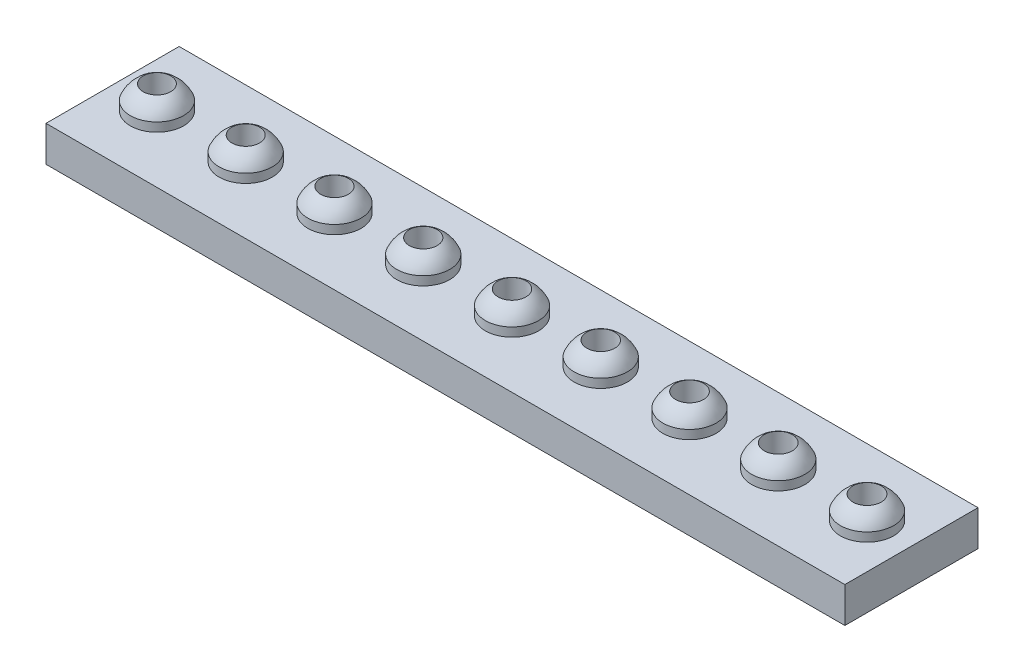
from build123d import *

# Parameters (mm, degrees)
SKETCH1_W                        = 90
SKETCH1_H                        = 15
BOSS_EXTRUDE1_DEPTH              = 4
SKETCH2_R                        = 3
BOSS_EXTRUDE2_DEPTH              = 1
DOME1_FACE_RADIUS                = 3
DOME1_HEIGHT                     = 2
LPATTERN1_COUNT                  = 5
LPATTERN1_PITCH                  = 10
LPATTERN1_COPY_1_FACE_RADIUS     = 3
LPATTERN1_COPY_1_HEIGHT          = 2
LPATTERN1_COPY_2_FACE_RADIUS     = 3
LPATTERN1_COPY_2_HEIGHT          = 2
LPATTERN1_COPY_3_FACE_RADIUS     = 3
LPATTERN1_COPY_3_HEIGHT          = 2
LPATTERN1_COPY_4_FACE_RADIUS     = 3
LPATTERN1_COPY_4_HEIGHT          = 2
LPATTERN1_COL_COUNT              = 5
LPATTERN1_COL_PITCH              = 10
LPATTERN1_COL_COPY_1_FACE_RADIUS = 3
LPATTERN1_COL_COPY_1_HEIGHT      = 2
LPATTERN1_COL_COPY_2_FACE_RADIUS = 3
LPATTERN1_COL_COPY_2_HEIGHT      = 2
LPATTERN1_COL_COPY_3_FACE_RADIUS = 3
LPATTERN1_COL_COPY_3_HEIGHT      = 2
LPATTERN1_COL_COPY_4_FACE_RADIUS = 3
LPATTERN1_COL_COPY_4_HEIGHT      = 2
CUT_EXTRUDE2_REACH               = 93.329
SKETCH3_R                        = 1.55
SKETCH3_R_2                      = 1.555
SKETCH3_R_3                      = 1.56
SKETCH3_R_4                      = 1.565
SKETCH3_R_5                      = 1.57
SKETCH3_R_6                      = 1.575
SKETCH3_R_7                      = 1.58
SKETCH3_R_8                      = 1.585
SKETCH3_R_9                      = 1.59
CUT_EXTRUDE2_DIRECTION_2_REACH   = 93.329


with BuildPart() as part:
    # Sketch1 → Boss-Extrude1 (new body)
    with BuildSketch(Plane(origin=(0, 0, 0), x_dir=(1, 0, 0), z_dir=(0, 1, 0))):
        with Locations((45, -7.5)):
            Rectangle(SKETCH1_W, SKETCH1_H)
    extrude(amount=BOSS_EXTRUDE1_DEPTH)

    # Sketch2 → Boss-Extrude2 (add)
    with BuildSketch(Plane(origin=(0, 4, 0), x_dir=(1, 0, 0), z_dir=(0, 1, 0))):
        with Locations(Location((45, -7.5, 0), (0, 0, 270))):
            Circle(SKETCH2_R)
    boss_extrude2 = extrude(amount=BOSS_EXTRUDE2_DEPTH)

    # Dome1: a dome of height H over a round flat face of radius A is a cap of a sphere of radius (A * A + H * H) / (2 * H)
    dome1_r = (DOME1_FACE_RADIUS * DOME1_FACE_RADIUS + DOME1_HEIGHT * DOME1_HEIGHT) / (2 * DOME1_HEIGHT)
    dome1_base = Plane((45, 5, 7.5), z_dir=(0, 1, 0))
    with Locations(dome1_base.offset(DOME1_HEIGHT - dome1_r)):
        dome1_ball = Sphere(dome1_r, mode=Mode.PRIVATE)
    add(split(dome1_ball, bisect_by=dome1_base, keep=Keep.TOP, mode=Mode.PRIVATE))

    # LPattern1: Boss-Extrude2 ×5
    with Locations(*[(-i * LPATTERN1_PITCH, 0, 0) for i in range(1, LPATTERN1_COUNT)]):
        add(boss_extrude2)

    # LPattern1 copy 1: a dome of height H over a round flat face of radius A is a cap of a sphere of radius (A * A + H * H) / (2 * H)
    lpattern1_copy_1_r = (LPATTERN1_COPY_1_FACE_RADIUS * LPATTERN1_COPY_1_FACE_RADIUS + LPATTERN1_COPY_1_HEIGHT * LPATTERN1_COPY_1_HEIGHT) / (2 * LPATTERN1_COPY_1_HEIGHT)
    lpattern1_copy_1_base = Plane((35, 5, 7.5), z_dir=(0, 1, 0))
    with Locations(lpattern1_copy_1_base.offset(LPATTERN1_COPY_1_HEIGHT - lpattern1_copy_1_r)):
        lpattern1_copy_1_ball = Sphere(lpattern1_copy_1_r, mode=Mode.PRIVATE)
    add(split(lpattern1_copy_1_ball, bisect_by=lpattern1_copy_1_base, keep=Keep.TOP, mode=Mode.PRIVATE))

    # LPattern1 copy 2: a dome of height H over a round flat face of radius A is a cap of a sphere of radius (A * A + H * H) / (2 * H)
    lpattern1_copy_2_r = (LPATTERN1_COPY_2_FACE_RADIUS * LPATTERN1_COPY_2_FACE_RADIUS + LPATTERN1_COPY_2_HEIGHT * LPATTERN1_COPY_2_HEIGHT) / (2 * LPATTERN1_COPY_2_HEIGHT)
    lpattern1_copy_2_base = Plane((25, 5, 7.5), z_dir=(0, 1, 0))
    with Locations(lpattern1_copy_2_base.offset(LPATTERN1_COPY_2_HEIGHT - lpattern1_copy_2_r)):
        lpattern1_copy_2_ball = Sphere(lpattern1_copy_2_r, mode=Mode.PRIVATE)
    add(split(lpattern1_copy_2_ball, bisect_by=lpattern1_copy_2_base, keep=Keep.TOP, mode=Mode.PRIVATE))

    # LPattern1 copy 3: a dome of height H over a round flat face of radius A is a cap of a sphere of radius (A * A + H * H) / (2 * H)
    lpattern1_copy_3_r = (LPATTERN1_COPY_3_FACE_RADIUS * LPATTERN1_COPY_3_FACE_RADIUS + LPATTERN1_COPY_3_HEIGHT * LPATTERN1_COPY_3_HEIGHT) / (2 * LPATTERN1_COPY_3_HEIGHT)
    lpattern1_copy_3_base = Plane((15, 5, 7.5), z_dir=(0, 1, 0))
    with Locations(lpattern1_copy_3_base.offset(LPATTERN1_COPY_3_HEIGHT - lpattern1_copy_3_r)):
        lpattern1_copy_3_ball = Sphere(lpattern1_copy_3_r, mode=Mode.PRIVATE)
    add(split(lpattern1_copy_3_ball, bisect_by=lpattern1_copy_3_base, keep=Keep.TOP, mode=Mode.PRIVATE))

    # LPattern1 copy 4: a dome of height H over a round flat face of radius A is a cap of a sphere of radius (A * A + H * H) / (2 * H)
    lpattern1_copy_4_r = (LPATTERN1_COPY_4_FACE_RADIUS * LPATTERN1_COPY_4_FACE_RADIUS + LPATTERN1_COPY_4_HEIGHT * LPATTERN1_COPY_4_HEIGHT) / (2 * LPATTERN1_COPY_4_HEIGHT)
    lpattern1_copy_4_base = Plane((5, 5, 7.5), z_dir=(0, 1, 0))
    with Locations(lpattern1_copy_4_base.offset(LPATTERN1_COPY_4_HEIGHT - lpattern1_copy_4_r)):
        lpattern1_copy_4_ball = Sphere(lpattern1_copy_4_r, mode=Mode.PRIVATE)
    add(split(lpattern1_copy_4_ball, bisect_by=lpattern1_copy_4_base, keep=Keep.TOP, mode=Mode.PRIVATE))

    # LPattern1 col: Boss-Extrude2 ×5
    with Locations(*[(i * LPATTERN1_COL_PITCH, 0, 0) for i in range(1, LPATTERN1_COL_COUNT)]):
        add(boss_extrude2)

    # LPattern1 col copy 1: a dome of height H over a round flat face of radius A is a cap of a sphere of radius (A * A + H * H) / (2 * H)
    lpattern1_col_copy_1_r = (LPATTERN1_COL_COPY_1_FACE_RADIUS * LPATTERN1_COL_COPY_1_FACE_RADIUS + LPATTERN1_COL_COPY_1_HEIGHT * LPATTERN1_COL_COPY_1_HEIGHT) / (2 * LPATTERN1_COL_COPY_1_HEIGHT)
    lpattern1_col_copy_1_base = Plane((55, 5, 7.5), z_dir=(0, 1, 0))
    with Locations(lpattern1_col_copy_1_base.offset(LPATTERN1_COL_COPY_1_HEIGHT - lpattern1_col_copy_1_r)):
        lpattern1_col_copy_1_ball = Sphere(lpattern1_col_copy_1_r, mode=Mode.PRIVATE)
    add(split(lpattern1_col_copy_1_ball, bisect_by=lpattern1_col_copy_1_base, keep=Keep.TOP, mode=Mode.PRIVATE))

    # LPattern1 col copy 2: a dome of height H over a round flat face of radius A is a cap of a sphere of radius (A * A + H * H) / (2 * H)
    lpattern1_col_copy_2_r = (LPATTERN1_COL_COPY_2_FACE_RADIUS * LPATTERN1_COL_COPY_2_FACE_RADIUS + LPATTERN1_COL_COPY_2_HEIGHT * LPATTERN1_COL_COPY_2_HEIGHT) / (2 * LPATTERN1_COL_COPY_2_HEIGHT)
    lpattern1_col_copy_2_base = Plane((65, 5, 7.5), z_dir=(0, 1, 0))
    with Locations(lpattern1_col_copy_2_base.offset(LPATTERN1_COL_COPY_2_HEIGHT - lpattern1_col_copy_2_r)):
        lpattern1_col_copy_2_ball = Sphere(lpattern1_col_copy_2_r, mode=Mode.PRIVATE)
    add(split(lpattern1_col_copy_2_ball, bisect_by=lpattern1_col_copy_2_base, keep=Keep.TOP, mode=Mode.PRIVATE))

    # LPattern1 col copy 3: a dome of height H over a round flat face of radius A is a cap of a sphere of radius (A * A + H * H) / (2 * H)
    lpattern1_col_copy_3_r = (LPATTERN1_COL_COPY_3_FACE_RADIUS * LPATTERN1_COL_COPY_3_FACE_RADIUS + LPATTERN1_COL_COPY_3_HEIGHT * LPATTERN1_COL_COPY_3_HEIGHT) / (2 * LPATTERN1_COL_COPY_3_HEIGHT)
    lpattern1_col_copy_3_base = Plane((75, 5, 7.5), z_dir=(0, 1, 0))
    with Locations(lpattern1_col_copy_3_base.offset(LPATTERN1_COL_COPY_3_HEIGHT - lpattern1_col_copy_3_r)):
        lpattern1_col_copy_3_ball = Sphere(lpattern1_col_copy_3_r, mode=Mode.PRIVATE)
    add(split(lpattern1_col_copy_3_ball, bisect_by=lpattern1_col_copy_3_base, keep=Keep.TOP, mode=Mode.PRIVATE))

    # LPattern1 col copy 4: a dome of height H over a round flat face of radius A is a cap of a sphere of radius (A * A + H * H) / (2 * H)
    lpattern1_col_copy_4_r = (LPATTERN1_COL_COPY_4_FACE_RADIUS * LPATTERN1_COL_COPY_4_FACE_RADIUS + LPATTERN1_COL_COPY_4_HEIGHT * LPATTERN1_COL_COPY_4_HEIGHT) / (2 * LPATTERN1_COL_COPY_4_HEIGHT)
    lpattern1_col_copy_4_base = Plane((85, 5, 7.5), z_dir=(0, 1, 0))
    with Locations(lpattern1_col_copy_4_base.offset(LPATTERN1_COL_COPY_4_HEIGHT - lpattern1_col_copy_4_r)):
        lpattern1_col_copy_4_ball = Sphere(lpattern1_col_copy_4_r, mode=Mode.PRIVATE)
    add(split(lpattern1_col_copy_4_ball, bisect_by=lpattern1_col_copy_4_base, keep=Keep.TOP, mode=Mode.PRIVATE))

    # Sketch3 → Cut-Extrude2 (cut, up to next)
    with BuildSketch(Plane(origin=(0, 4, 0), x_dir=(1, 0, 0), z_dir=(0, 1, 0)), mode=Mode.PRIVATE) as cut_extrude2_sk1:
        with Locations(Location((5, -7.5, 0), (0, 0, 90))):
            Circle(SKETCH3_R)
    cut_extrude2_tool1 = extrude(cut_extrude2_sk1.sketch, amount=-CUT_EXTRUDE2_REACH, mode=Mode.PRIVATE) & part.part
    # Sketch3 → Cut-Extrude2 (cut, up to next)
    with BuildSketch(Plane(origin=(0, 4, 0), x_dir=(1, 0, 0), z_dir=(0, 1, 0)), mode=Mode.PRIVATE) as cut_extrude2_sk2:
        with Locations(Location((15, -7.5, 0), (0, 0, 90))):
            Circle(SKETCH3_R_2)
    cut_extrude2_tool2 = extrude(cut_extrude2_sk2.sketch, amount=-CUT_EXTRUDE2_REACH, mode=Mode.PRIVATE) & part.part
    # Sketch3 → Cut-Extrude2 (cut, up to next)
    with BuildSketch(Plane(origin=(0, 4, 0), x_dir=(1, 0, 0), z_dir=(0, 1, 0)), mode=Mode.PRIVATE) as cut_extrude2_sk3:
        with Locations(Location((25, -7.5, 0), (0, 0, 90))):
            Circle(SKETCH3_R_3)
    cut_extrude2_tool3 = extrude(cut_extrude2_sk3.sketch, amount=-CUT_EXTRUDE2_REACH, mode=Mode.PRIVATE) & part.part
    # Sketch3 → Cut-Extrude2 (cut, up to next)
    with BuildSketch(Plane(origin=(0, 4, 0), x_dir=(1, 0, 0), z_dir=(0, 1, 0)), mode=Mode.PRIVATE) as cut_extrude2_sk4:
        with Locations(Location((35, -7.5, 0), (0, 0, 90))):
            Circle(SKETCH3_R_4)
    cut_extrude2_tool4 = extrude(cut_extrude2_sk4.sketch, amount=-CUT_EXTRUDE2_REACH, mode=Mode.PRIVATE) & part.part
    # Sketch3 → Cut-Extrude2 (cut, up to next)
    with BuildSketch(Plane(origin=(0, 4, 0), x_dir=(1, 0, 0), z_dir=(0, 1, 0)), mode=Mode.PRIVATE) as cut_extrude2_sk5:
        with Locations(Location((45, -7.5, 0), (0, 0, 90))):
            Circle(SKETCH3_R_5)
    cut_extrude2_tool5 = extrude(cut_extrude2_sk5.sketch, amount=-CUT_EXTRUDE2_REACH, mode=Mode.PRIVATE) & part.part
    # Sketch3 → Cut-Extrude2 (cut, up to next)
    with BuildSketch(Plane(origin=(0, 4, 0), x_dir=(1, 0, 0), z_dir=(0, 1, 0)), mode=Mode.PRIVATE) as cut_extrude2_sk6:
        with Locations(Location((55, -7.5, 0), (0, 0, 90))):
            Circle(SKETCH3_R_6)
    cut_extrude2_tool6 = extrude(cut_extrude2_sk6.sketch, amount=-CUT_EXTRUDE2_REACH, mode=Mode.PRIVATE) & part.part
    # Sketch3 → Cut-Extrude2 (cut, up to next)
    with BuildSketch(Plane(origin=(0, 4, 0), x_dir=(1, 0, 0), z_dir=(0, 1, 0)), mode=Mode.PRIVATE) as cut_extrude2_sk7:
        with Locations(Location((65, -7.5, 0), (0, 0, 90))):
            Circle(SKETCH3_R_7)
    cut_extrude2_tool7 = extrude(cut_extrude2_sk7.sketch, amount=-CUT_EXTRUDE2_REACH, mode=Mode.PRIVATE) & part.part
    # Sketch3 → Cut-Extrude2 (cut, up to next)
    with BuildSketch(Plane(origin=(0, 4, 0), x_dir=(1, 0, 0), z_dir=(0, 1, 0)), mode=Mode.PRIVATE) as cut_extrude2_sk8:
        with Locations(Location((75, -7.5, 0), (0, 0, 90))):
            Circle(SKETCH3_R_8)
    cut_extrude2_tool8 = extrude(cut_extrude2_sk8.sketch, amount=-CUT_EXTRUDE2_REACH, mode=Mode.PRIVATE) & part.part
    # Sketch3 → Cut-Extrude2 (cut, up to next)
    with BuildSketch(Plane(origin=(0, 4, 0), x_dir=(1, 0, 0), z_dir=(0, 1, 0)), mode=Mode.PRIVATE) as cut_extrude2_sk9:
        with Locations(Location((85, -7.5, 0), (0, 0, 90))):
            Circle(SKETCH3_R_9)
    cut_extrude2_tool9 = extrude(cut_extrude2_sk9.sketch, amount=-CUT_EXTRUDE2_REACH, mode=Mode.PRIVATE) & part.part
    add(cut_extrude2_tool1.solids().sort_by_distance((5, 4, 7.5))[0], mode=Mode.SUBTRACT)
    add(cut_extrude2_tool2.solids().sort_by_distance((15, 4, 7.5))[0], mode=Mode.SUBTRACT)
    add(cut_extrude2_tool3.solids().sort_by_distance((25, 4, 7.5))[0], mode=Mode.SUBTRACT)
    add(cut_extrude2_tool4.solids().sort_by_distance((35, 4, 7.5))[0], mode=Mode.SUBTRACT)
    add(cut_extrude2_tool5.solids().sort_by_distance((45, 4, 7.5))[0], mode=Mode.SUBTRACT)
    add(cut_extrude2_tool6.solids().sort_by_distance((55, 4, 7.5))[0], mode=Mode.SUBTRACT)
    add(cut_extrude2_tool7.solids().sort_by_distance((65, 4, 7.5))[0], mode=Mode.SUBTRACT)
    add(cut_extrude2_tool8.solids().sort_by_distance((75, 4, 7.5))[0], mode=Mode.SUBTRACT)
    add(cut_extrude2_tool9.solids().sort_by_distance((85, 4, 7.5))[0], mode=Mode.SUBTRACT)

    # Sketch3 → Cut-Extrude2 direction 2 (cut, up to next)
    with BuildSketch(Plane(origin=(0, 4, 0), x_dir=(1, 0, 0), z_dir=(0, 1, 0)), mode=Mode.PRIVATE) as cut_extrude2_direction_2_sk1:
        with Locations(Location((5, -7.5, 0), (0, 0, 90))):
            Circle(SKETCH3_R)
    cut_extrude2_direction_2_tool1 = extrude(cut_extrude2_direction_2_sk1.sketch, amount=CUT_EXTRUDE2_DIRECTION_2_REACH, mode=Mode.PRIVATE) & part.part
    # Sketch3 → Cut-Extrude2 direction 2 (cut, up to next)
    with BuildSketch(Plane(origin=(0, 4, 0), x_dir=(1, 0, 0), z_dir=(0, 1, 0)), mode=Mode.PRIVATE) as cut_extrude2_direction_2_sk2:
        with Locations(Location((15, -7.5, 0), (0, 0, 90))):
            Circle(SKETCH3_R_2)
    cut_extrude2_direction_2_tool2 = extrude(cut_extrude2_direction_2_sk2.sketch, amount=CUT_EXTRUDE2_DIRECTION_2_REACH, mode=Mode.PRIVATE) & part.part
    # Sketch3 → Cut-Extrude2 direction 2 (cut, up to next)
    with BuildSketch(Plane(origin=(0, 4, 0), x_dir=(1, 0, 0), z_dir=(0, 1, 0)), mode=Mode.PRIVATE) as cut_extrude2_direction_2_sk3:
        with Locations(Location((25, -7.5, 0), (0, 0, 90))):
            Circle(SKETCH3_R_3)
    cut_extrude2_direction_2_tool3 = extrude(cut_extrude2_direction_2_sk3.sketch, amount=CUT_EXTRUDE2_DIRECTION_2_REACH, mode=Mode.PRIVATE) & part.part
    # Sketch3 → Cut-Extrude2 direction 2 (cut, up to next)
    with BuildSketch(Plane(origin=(0, 4, 0), x_dir=(1, 0, 0), z_dir=(0, 1, 0)), mode=Mode.PRIVATE) as cut_extrude2_direction_2_sk4:
        with Locations(Location((35, -7.5, 0), (0, 0, 90))):
            Circle(SKETCH3_R_4)
    cut_extrude2_direction_2_tool4 = extrude(cut_extrude2_direction_2_sk4.sketch, amount=CUT_EXTRUDE2_DIRECTION_2_REACH, mode=Mode.PRIVATE) & part.part
    # Sketch3 → Cut-Extrude2 direction 2 (cut, up to next)
    with BuildSketch(Plane(origin=(0, 4, 0), x_dir=(1, 0, 0), z_dir=(0, 1, 0)), mode=Mode.PRIVATE) as cut_extrude2_direction_2_sk5:
        with Locations(Location((45, -7.5, 0), (0, 0, 90))):
            Circle(SKETCH3_R_5)
    cut_extrude2_direction_2_tool5 = extrude(cut_extrude2_direction_2_sk5.sketch, amount=CUT_EXTRUDE2_DIRECTION_2_REACH, mode=Mode.PRIVATE) & part.part
    # Sketch3 → Cut-Extrude2 direction 2 (cut, up to next)
    with BuildSketch(Plane(origin=(0, 4, 0), x_dir=(1, 0, 0), z_dir=(0, 1, 0)), mode=Mode.PRIVATE) as cut_extrude2_direction_2_sk6:
        with Locations(Location((55, -7.5, 0), (0, 0, 90))):
            Circle(SKETCH3_R_6)
    cut_extrude2_direction_2_tool6 = extrude(cut_extrude2_direction_2_sk6.sketch, amount=CUT_EXTRUDE2_DIRECTION_2_REACH, mode=Mode.PRIVATE) & part.part
    # Sketch3 → Cut-Extrude2 direction 2 (cut, up to next)
    with BuildSketch(Plane(origin=(0, 4, 0), x_dir=(1, 0, 0), z_dir=(0, 1, 0)), mode=Mode.PRIVATE) as cut_extrude2_direction_2_sk7:
        with Locations(Location((65, -7.5, 0), (0, 0, 90))):
            Circle(SKETCH3_R_7)
    cut_extrude2_direction_2_tool7 = extrude(cut_extrude2_direction_2_sk7.sketch, amount=CUT_EXTRUDE2_DIRECTION_2_REACH, mode=Mode.PRIVATE) & part.part
    # Sketch3 → Cut-Extrude2 direction 2 (cut, up to next)
    with BuildSketch(Plane(origin=(0, 4, 0), x_dir=(1, 0, 0), z_dir=(0, 1, 0)), mode=Mode.PRIVATE) as cut_extrude2_direction_2_sk8:
        with Locations(Location((75, -7.5, 0), (0, 0, 90))):
            Circle(SKETCH3_R_8)
    cut_extrude2_direction_2_tool8 = extrude(cut_extrude2_direction_2_sk8.sketch, amount=CUT_EXTRUDE2_DIRECTION_2_REACH, mode=Mode.PRIVATE) & part.part
    # Sketch3 → Cut-Extrude2 direction 2 (cut, up to next)
    with BuildSketch(Plane(origin=(0, 4, 0), x_dir=(1, 0, 0), z_dir=(0, 1, 0)), mode=Mode.PRIVATE) as cut_extrude2_direction_2_sk9:
        with Locations(Location((85, -7.5, 0), (0, 0, 90))):
            Circle(SKETCH3_R_9)
    cut_extrude2_direction_2_tool9 = extrude(cut_extrude2_direction_2_sk9.sketch, amount=CUT_EXTRUDE2_DIRECTION_2_REACH, mode=Mode.PRIVATE) & part.part
    add(cut_extrude2_direction_2_tool1.solids().sort_by_distance((5, 4, 7.5))[0], mode=Mode.SUBTRACT)
    add(cut_extrude2_direction_2_tool2.solids().sort_by_distance((15, 4, 7.5))[0], mode=Mode.SUBTRACT)
    add(cut_extrude2_direction_2_tool3.solids().sort_by_distance((25, 4, 7.5))[0], mode=Mode.SUBTRACT)
    add(cut_extrude2_direction_2_tool4.solids().sort_by_distance((35, 4, 7.5))[0], mode=Mode.SUBTRACT)
    add(cut_extrude2_direction_2_tool5.solids().sort_by_distance((45, 4, 7.5))[0], mode=Mode.SUBTRACT)
    add(cut_extrude2_direction_2_tool6.solids().sort_by_distance((55, 4, 7.5))[0], mode=Mode.SUBTRACT)
    add(cut_extrude2_direction_2_tool7.solids().sort_by_distance((65, 4, 7.5))[0], mode=Mode.SUBTRACT)
    add(cut_extrude2_direction_2_tool8.solids().sort_by_distance((75, 4, 7.5))[0], mode=Mode.SUBTRACT)
    add(cut_extrude2_direction_2_tool9.solids().sort_by_distance((85, 4, 7.5))[0], mode=Mode.SUBTRACT)


solid = part.part
